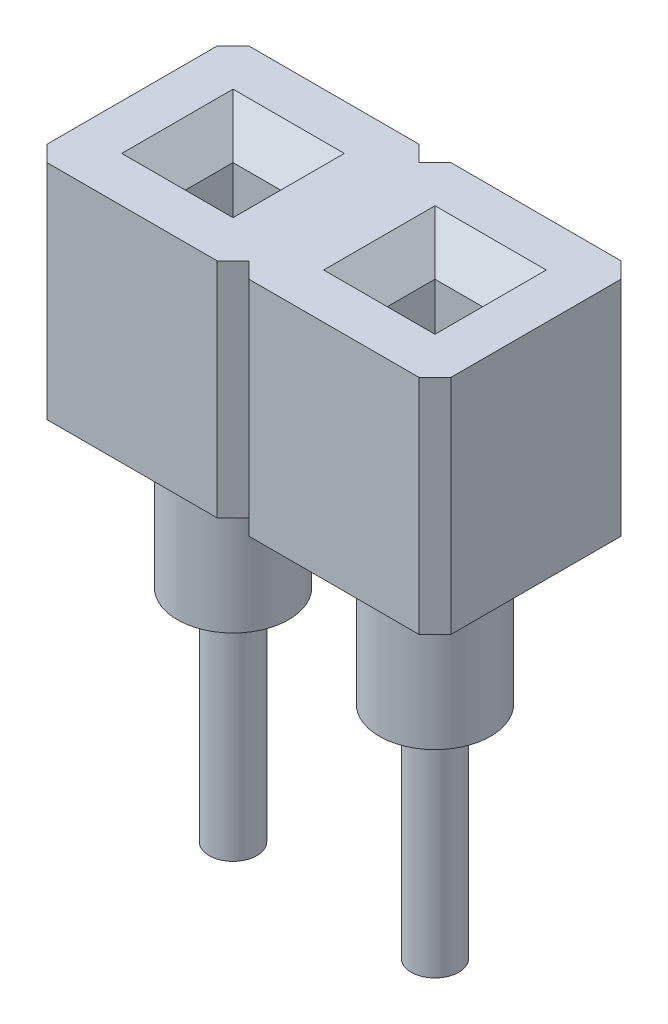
from build123d import *

# Parameters (mm, degrees)
ESQUISSE1_W                = 0.6
ESQUISSE1_H                = 0.6
EXTRUSION1_DEPTH           = 2.8
CHANFREIN1_SIZE            = 0.4
R_P_TITION_LIN_AIRE1_COUNT = 2
R_P_TITION_LIN_AIRE1_PITCH = 2.54


with BuildPart() as part:
    # Esquisse1 → Extrusion1 (new body)
    with BuildSketch(Plane(origin=(0, 0, 0), x_dir=(1, 0, 0), z_dir=(0, 1, 0))):
        Polygon((1.27, 1.07), (1.27, -1.07), (1.07, -1.27), (-1.07, -1.27), (-1.27, -1.07), (-1.27, 1.07), (-1.07, 1.27), (1.07, 1.27), align=None)
        Rectangle(ESQUISSE1_W, ESQUISSE1_H, mode=Mode.SUBTRACT)
    extrude(amount=EXTRUSION1_DEPTH)

    # Esquisse2 → R_volution1 (revolve)
    with BuildSketch(Plane.XY, mode=Mode.PRIVATE) as r_volution1_sk:
        Polygon((0, 0), (0, -4.7), (0.3, -4.7), (0.3, -2.2), (0.7, -1.93), (0.7, 0), align=None)
    revolve(r_volution1_sk.sketch.rotate(Axis((0, 0, 0), (0, -1, 0)), 180), axis=Axis((0, 0, 0), (0, -1, 0)))

    # Chanfrein1
    chanfrein1_edges = [part.edges().sort_by_distance(p)[0] for p in [
        (-0.3, 2.8, 0),
        (0, 2.8, 0.3),
        (0.3, 2.8, 0),
        (0, 2.8, -0.3),
    ]]
    chamfer(chanfrein1_edges, length=CHANFREIN1_SIZE)

    # R_p_tition lin_aire1: part ×2


with BuildPart() as part_1:
    add(part.part)
    with Locations(*[(-i * R_P_TITION_LIN_AIRE1_PITCH, 0, 0) for i in range(1, R_P_TITION_LIN_AIRE1_COUNT)]):
        add(part.part)


solid = part_1.part
